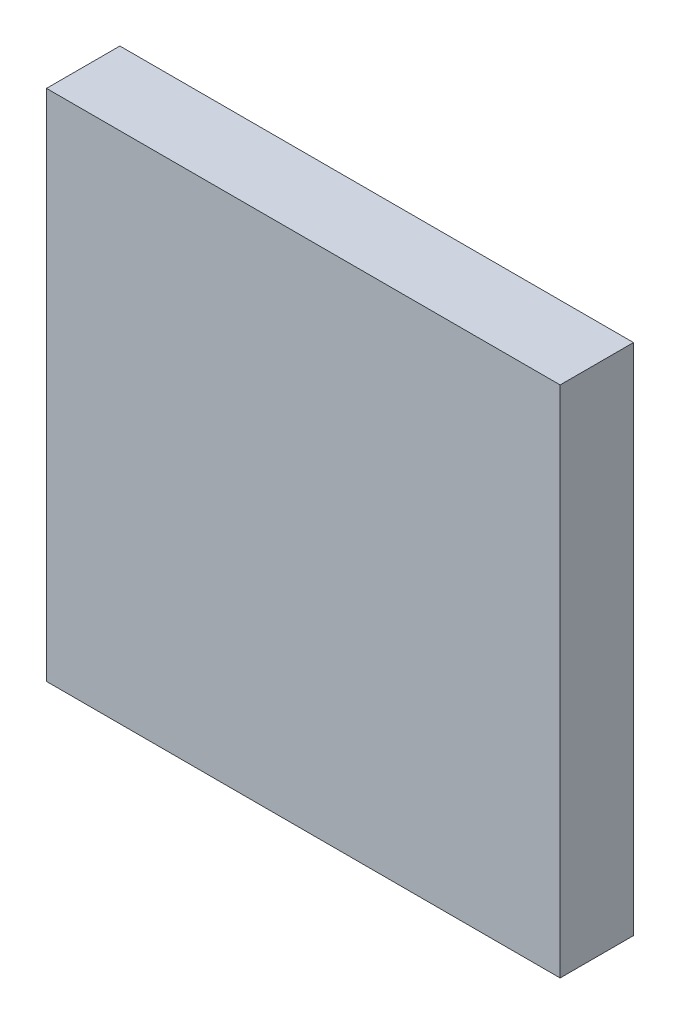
from build123d import *

# Parameters (mm, degrees)
SKETCH1_W           = 70
SKETCH1_H           = 70
BOSS_EXTRUDE1_DEPTH = 10


with BuildPart() as part:
    # Sketch1 → Boss-Extrude1 (new body)
    with BuildSketch(Plane.XY):
        with Locations((35, 35)):
            Rectangle(SKETCH1_W, SKETCH1_H)
    extrude(amount=BOSS_EXTRUDE1_DEPTH)


solid = part.part
